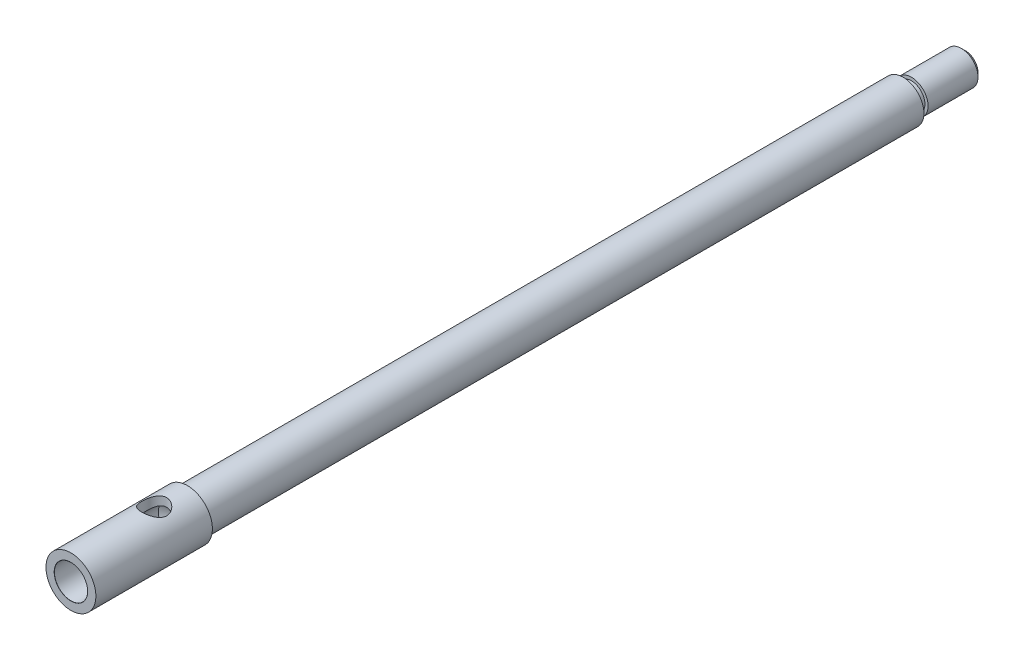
ISO-10303-21;
HEADER;
FILE_DESCRIPTION(('STEP AP214'),'2;1');
FILE_NAME('part.step','',(''),(''),'','','');
FILE_SCHEMA(('AUTOMOTIVE_DESIGN { 1 0 10303 214 1 1 1 1 }'));
ENDSEC;
DATA;
#1=APPLICATION_CONTEXT('core data for automotive mechanical design processes');
#2=APPLICATION_PROTOCOL_DEFINITION('international standard','automotive_design',2000,#1);
#3=PRODUCT_CONTEXT('',#1,'mechanical');
#4=PRODUCT('Part','Part','',(#3));
#5=PRODUCT_RELATED_PRODUCT_CATEGORY('part','',(#4));
#6=PRODUCT_DEFINITION_FORMATION('','',#4);
#7=PRODUCT_DEFINITION_CONTEXT('part definition',#1,'design');
#8=PRODUCT_DEFINITION('design','',#6,#7);
#9=PRODUCT_DEFINITION_SHAPE('','',#8);
#10=(LENGTH_UNIT() NAMED_UNIT(*) SI_UNIT(.MILLI.,.METRE.));
#11=(NAMED_UNIT(*) PLANE_ANGLE_UNIT() SI_UNIT($,.RADIAN.));
#12=(NAMED_UNIT(*) SI_UNIT($,.STERADIAN.) SOLID_ANGLE_UNIT());
#13=UNCERTAINTY_MEASURE_WITH_UNIT(LENGTH_MEASURE(1.E-05),#10,'distance_accuracy_value','');
#14=(GEOMETRIC_REPRESENTATION_CONTEXT(3) GLOBAL_UNCERTAINTY_ASSIGNED_CONTEXT((#13)) GLOBAL_UNIT_ASSIGNED_CONTEXT((#10,
#11,#12)) REPRESENTATION_CONTEXT('',''));
#15=CARTESIAN_POINT('',(0.,0.,0.));
#16=DIRECTION('',(0.,0.,1.));
#17=DIRECTION('',(1.,0.,0.));
#18=AXIS2_PLACEMENT_3D('',#15,#16,#17);
#19=CARTESIAN_POINT('',(0.,0.,13.));
#20=DIRECTION('',(0.,0.,-1.));
#21=DIRECTION('',(-1.,0.,0.));
#22=AXIS2_PLACEMENT_3D('',#19,#20,#21);
#23=CYLINDRICAL_SURFACE('',#22,4.);
#24=CARTESIAN_POINT('',(0.,0.,1.00000000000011));
#25=DIRECTION('',(0.,0.,1.));
#26=DIRECTION('',(1.,0.,0.));
#27=AXIS2_PLACEMENT_3D('',#24,#25,#26);
#28=CIRCLE('',#27,4.);
#29=CARTESIAN_POINT('',(-4.,0.,1.00000000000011));
#30=VERTEX_POINT('',#29);
#31=EDGE_CURVE('E100',#30,#30,#28,.T.);
#32=CARTESIAN_POINT('',(0.,0.,13.));
#33=DIRECTION('',(0.,0.,1.));
#34=DIRECTION('',(1.,0.,0.));
#35=AXIS2_PLACEMENT_3D('',#32,#33,#34);
#36=CIRCLE('',#35,4.);
#37=CARTESIAN_POINT('',(-4.,0.,13.));
#38=VERTEX_POINT('',#37);
#39=EDGE_CURVE('E96',#38,#38,#36,.T.);
#40=CARTESIAN_POINT('',(-4.,0.,1.00000000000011));
#41=CARTESIAN_POINT('',(-4.,0.,1.1250000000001));
#42=CARTESIAN_POINT('',(-4.,0.,1.2500000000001));
#43=CARTESIAN_POINT('',(-4.,0.,1.5000000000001));
#44=CARTESIAN_POINT('',(-4.,0.,1.6250000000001));
#45=CARTESIAN_POINT('',(-4.,0.,1.8750000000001));
#46=CARTESIAN_POINT('',(-4.,0.,2.0000000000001));
#47=CARTESIAN_POINT('',(-4.,0.,2.25000000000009));
#48=CARTESIAN_POINT('',(-4.,0.,2.37500000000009));
#49=CARTESIAN_POINT('',(-4.,0.,2.62500000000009));
#50=CARTESIAN_POINT('',(-4.,0.,2.75000000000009));
#51=CARTESIAN_POINT('',(-4.,0.,3.00000000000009));
#52=CARTESIAN_POINT('',(-4.,0.,3.12500000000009));
#53=CARTESIAN_POINT('',(-4.,0.,3.37500000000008));
#54=CARTESIAN_POINT('',(-4.,0.,3.50000000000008));
#55=CARTESIAN_POINT('',(-4.,0.,3.75000000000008));
#56=CARTESIAN_POINT('',(-4.,0.,3.87500000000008));
#57=CARTESIAN_POINT('',(-4.,0.,4.12500000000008));
#58=CARTESIAN_POINT('',(-4.,0.,4.25000000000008));
#59=CARTESIAN_POINT('',(-4.,0.,4.50000000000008));
#60=CARTESIAN_POINT('',(-4.,0.,4.62500000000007));
#61=CARTESIAN_POINT('',(-4.,0.,4.87500000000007));
#62=CARTESIAN_POINT('',(-4.,0.,5.00000000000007));
#63=CARTESIAN_POINT('',(-4.,0.,5.25000000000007));
#64=CARTESIAN_POINT('',(-4.,0.,5.37500000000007));
#65=CARTESIAN_POINT('',(-4.,0.,5.62500000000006));
#66=CARTESIAN_POINT('',(-4.,0.,5.75000000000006));
#67=CARTESIAN_POINT('',(-4.,0.,6.00000000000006));
#68=CARTESIAN_POINT('',(-4.,0.,6.12500000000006));
#69=CARTESIAN_POINT('',(-4.,0.,6.37500000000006));
#70=CARTESIAN_POINT('',(-4.,0.,6.50000000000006));
#71=CARTESIAN_POINT('',(-4.,0.,6.75000000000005));
#72=CARTESIAN_POINT('',(-4.,0.,6.87500000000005));
#73=CARTESIAN_POINT('',(-4.,0.,7.12500000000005));
#74=CARTESIAN_POINT('',(-4.,0.,7.25000000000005));
#75=CARTESIAN_POINT('',(-4.,0.,7.50000000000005));
#76=CARTESIAN_POINT('',(-4.,0.,7.62500000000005));
#77=CARTESIAN_POINT('',(-4.,0.,7.87500000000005));
#78=CARTESIAN_POINT('',(-4.,0.,8.00000000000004));
#79=CARTESIAN_POINT('',(-4.,0.,8.25000000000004));
#80=CARTESIAN_POINT('',(-4.,0.,8.37500000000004));
#81=CARTESIAN_POINT('',(-4.,0.,8.62500000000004));
#82=CARTESIAN_POINT('',(-4.,0.,8.75000000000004));
#83=CARTESIAN_POINT('',(-4.,0.,9.00000000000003));
#84=CARTESIAN_POINT('',(-4.,0.,9.12500000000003));
#85=CARTESIAN_POINT('',(-4.,0.,9.37500000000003));
#86=CARTESIAN_POINT('',(-4.,0.,9.50000000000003));
#87=CARTESIAN_POINT('',(-4.,0.,9.75000000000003));
#88=CARTESIAN_POINT('',(-4.,0.,9.87500000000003));
#89=CARTESIAN_POINT('',(-4.,0.,10.125));
#90=CARTESIAN_POINT('',(-4.,0.,10.25));
#91=CARTESIAN_POINT('',(-4.,0.,10.5));
#92=CARTESIAN_POINT('',(-4.,0.,10.625));
#93=CARTESIAN_POINT('',(-4.,0.,10.875));
#94=CARTESIAN_POINT('',(-4.,0.,11.));
#95=CARTESIAN_POINT('',(-4.,0.,11.25));
#96=CARTESIAN_POINT('',(-4.,0.,11.375));
#97=CARTESIAN_POINT('',(-4.,0.,11.625));
#98=CARTESIAN_POINT('',(-4.,0.,11.75));
#99=CARTESIAN_POINT('',(-4.,0.,12.));
#100=CARTESIAN_POINT('',(-4.,0.,12.125));
#101=CARTESIAN_POINT('',(-4.,0.,12.375));
#102=CARTESIAN_POINT('',(-4.,0.,12.5));
#103=CARTESIAN_POINT('',(-4.,0.,12.75));
#104=CARTESIAN_POINT('',(-4.,0.,12.875));
#105=CARTESIAN_POINT('',(-4.,0.,13.));
#106=B_SPLINE_CURVE_WITH_KNOTS('',3,(#40,#41,#42,#43,#44,#45,#46,#47,#48,#49,#50,#51,#52,#53,
#54,#55,#56,#57,#58,#59,#60,#61,#62,#63,#64,#65,#66,#67,#68,#69,#70,#71,#72,#73,#74,#75,#76,#77,
#78,#79,#80,#81,#82,#83,#84,#85,#86,#87,#88,#89,#90,#91,#92,#93,#94,#95,#96,#97,#98,#99,#100,
#101,#102,#103,#104,#105),.UNSPECIFIED.,.F.,.F.,(4,2,2,2,2,2,2,2,2,2,2,2,2,2,2,2,2,2,2,2,2,2,2,
2,2,2,2,2,2,2,2,2,4),(0.,0.374999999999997,0.749999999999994,1.12499999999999,1.49999999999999,
1.87499999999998,2.24999999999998,2.62499999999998,2.99999999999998,3.37499999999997,
3.74999999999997,4.12499999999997,4.49999999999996,4.87499999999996,5.24999999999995,
5.62499999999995,5.99999999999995,6.37499999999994,6.74999999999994,7.12499999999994,
7.49999999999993,7.87499999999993,8.24999999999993,8.62499999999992,8.99999999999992,
9.37499999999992,9.74999999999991,10.1249999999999,10.4999999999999,10.8749999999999,
11.2499999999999,11.6249999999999,11.9999999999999),.UNSPECIFIED.);
#107=EDGE_CURVE('BSEAM49',#30,#38,#106,.T.);
#108=ORIENTED_EDGE('',*,*,#31,.T.);
#109=ORIENTED_EDGE('',*,*,#39,.F.);
#110=ORIENTED_EDGE('',*,*,#107,.T.);
#111=ORIENTED_EDGE('',*,*,#107,.F.);
#112=EDGE_LOOP('',(#108,#110,#109,#111));
#113=FACE_BOUND('',#112,.T.);
#114=ADVANCED_FACE('F49',(#113),#23,.T.);
#115=CARTESIAN_POINT('',(0.,0.,13.));
#116=DIRECTION('',(0.,0.,1.));
#117=DIRECTION('',(1.,0.,0.));
#118=AXIS2_PLACEMENT_3D('',#115,#116,#117);
#119=PLANE('',#118);
#120=CARTESIAN_POINT('',(0.,0.,13.));
#121=DIRECTION('',(0.,0.,1.));
#122=DIRECTION('',(1.,0.,0.));
#123=AXIS2_PLACEMENT_3D('',#120,#121,#122);
#124=CIRCLE('',#123,3.25);
#125=CARTESIAN_POINT('',(3.25,0.,13.));
#126=VERTEX_POINT('',#125);
#127=EDGE_CURVE('E97',#126,#126,#124,.T.);
#128=ORIENTED_EDGE('',*,*,#127,.F.);
#129=EDGE_LOOP('',(#128));
#130=FACE_BOUND('',#129,.T.);
#131=ORIENTED_EDGE('',*,*,#39,.T.);
#132=EDGE_LOOP('',(#131));
#133=FACE_BOUND('',#132,.T.);
#134=ADVANCED_FACE('F156',(#130,#133),#119,.T.);
#135=CARTESIAN_POINT('',(0.,0.,0.));
#136=DIRECTION('',(0.,0.,1.));
#137=DIRECTION('',(1.,0.,0.));
#138=AXIS2_PLACEMENT_3D('',#135,#136,#137);
#139=PLANE('',#138);
#140=CARTESIAN_POINT('',(0.,0.,0.));
#141=DIRECTION('',(0.,0.,1.));
#142=DIRECTION('',(1.,0.,0.));
#143=AXIS2_PLACEMENT_3D('',#140,#141,#142);
#144=CIRCLE('',#143,2.99999999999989);
#145=CARTESIAN_POINT('',(2.99999999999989,0.,0.));
#146=VERTEX_POINT('',#145);
#147=EDGE_CURVE('E105',#146,#146,#144,.F.);
#148=ORIENTED_EDGE('',*,*,#147,.T.);
#149=EDGE_LOOP('',(#148));
#150=FACE_BOUND('',#149,.T.);
#151=ADVANCED_FACE('F161',(#150),#139,.F.);
#152=CARTESIAN_POINT('',(0.,0.,15.));
#153=DIRECTION('',(0.,0.,-1.));
#154=DIRECTION('',(-1.,0.,0.));
#155=AXIS2_PLACEMENT_3D('',#152,#153,#154);
#156=CYLINDRICAL_SURFACE('',#155,3.25);
#157=CARTESIAN_POINT('',(0.,0.,15.));
#158=DIRECTION('',(0.,0.,1.));
#159=DIRECTION('',(1.,0.,0.));
#160=AXIS2_PLACEMENT_3D('',#157,#158,#159);
#161=CIRCLE('',#160,3.25);
#162=CARTESIAN_POINT('',(3.25,0.,15.));
#163=VERTEX_POINT('',#162);
#164=EDGE_CURVE('E91',#163,#163,#161,.T.);
#165=ORIENTED_EDGE('',*,*,#164,.F.);
#166=EDGE_LOOP('',(#165));
#167=FACE_BOUND('',#166,.T.);
#168=ORIENTED_EDGE('',*,*,#127,.T.);
#169=EDGE_LOOP('',(#168));
#170=FACE_BOUND('',#169,.T.);
#171=ADVANCED_FACE('F167',(#167,#170),#156,.T.);
#172=CARTESIAN_POINT('',(0.,0.,187.));
#173=DIRECTION('',(0.,0.,-1.));
#174=DIRECTION('',(-1.,0.,0.));
#175=AXIS2_PLACEMENT_3D('',#172,#173,#174);
#176=CYLINDRICAL_SURFACE('',#175,5.);
#177=CARTESIAN_POINT('',(0.,0.,187.));
#178=DIRECTION('',(0.,0.,1.));
#179=DIRECTION('',(1.,0.,0.));
#180=AXIS2_PLACEMENT_3D('',#177,#178,#179);
#181=CIRCLE('',#180,5.);
#182=CARTESIAN_POINT('',(5.,0.,187.));
#183=VERTEX_POINT('',#182);
#184=EDGE_CURVE('E88',#183,#183,#181,.T.);
#185=ORIENTED_EDGE('',*,*,#184,.F.);
#186=EDGE_LOOP('',(#185));
#187=FACE_BOUND('',#186,.T.);
#188=CARTESIAN_POINT('',(0.,0.,15.));
#189=DIRECTION('',(0.,0.,1.));
#190=DIRECTION('',(1.,0.,0.));
#191=AXIS2_PLACEMENT_3D('',#188,#189,#190);
#192=CIRCLE('',#191,5.);
#193=CARTESIAN_POINT('',(5.,0.,15.));
#194=VERTEX_POINT('',#193);
#195=EDGE_CURVE('E86',#194,#194,#192,.T.);
#196=ORIENTED_EDGE('',*,*,#195,.T.);
#197=EDGE_LOOP('',(#196));
#198=FACE_BOUND('',#197,.T.);
#199=ADVANCED_FACE('F172',(#187,#198),#176,.T.);
#200=CARTESIAN_POINT('',(0.,0.,15.));
#201=DIRECTION('',(0.,0.,1.));
#202=DIRECTION('',(1.,0.,0.));
#203=AXIS2_PLACEMENT_3D('',#200,#201,#202);
#204=PLANE('',#203);
#205=ORIENTED_EDGE('',*,*,#164,.T.);
#206=EDGE_LOOP('',(#205));
#207=FACE_BOUND('',#206,.T.);
#208=ORIENTED_EDGE('',*,*,#195,.F.);
#209=EDGE_LOOP('',(#208));
#210=FACE_BOUND('',#209,.T.);
#211=ADVANCED_FACE('F175',(#207,#210),#204,.F.);
#212=CARTESIAN_POINT('',(0.,0.,215.));
#213=DIRECTION('',(0.,0.,-1.));
#214=DIRECTION('',(-1.,0.,0.));
#215=AXIS2_PLACEMENT_3D('',#212,#213,#214);
#216=CYLINDRICAL_SURFACE('',#215,6.);
#217=CARTESIAN_POINT('',(0.,-6.,198.));
#218=CARTESIAN_POINT('',(0.0788941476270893,-5.99999934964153,197.999999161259));
#219=CARTESIAN_POINT('',(0.157796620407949,-5.99843869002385,197.996882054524));
#220=CARTESIAN_POINT('',(0.31500199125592,-5.99224358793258,197.98446072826));
#221=CARTESIAN_POINT('',(0.393304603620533,-5.98760776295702,197.975153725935));
#222=CARTESIAN_POINT('',(0.626628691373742,-5.96921978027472,197.938042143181));
#223=CARTESIAN_POINT('',(0.779952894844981,-5.95098734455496,197.901047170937));
#224=CARTESIAN_POINT('',(1.07683586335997,-5.90448966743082,197.804418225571));
#225=CARTESIAN_POINT('',(1.22043005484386,-5.87626344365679,197.744872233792));
#226=CARTESIAN_POINT('',(1.49540820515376,-5.81237302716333,197.605288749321));
#227=CARTESIAN_POINT('',(1.62679312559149,-5.77670942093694,197.525252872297));
#228=CARTESIAN_POINT('',(1.88252701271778,-5.69868752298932,197.34144601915));
#229=CARTESIAN_POINT('',(2.0059694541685,-5.65605474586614,197.236532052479));
#230=CARTESIAN_POINT('',(2.23433451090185,-5.56980033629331,197.008444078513));
#231=CARTESIAN_POINT('',(2.3392430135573,-5.5261779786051,196.885256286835));
#232=CARTESIAN_POINT('',(2.53576864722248,-5.43896347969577,196.612515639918));
#233=CARTESIAN_POINT('',(2.625724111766,-5.3956360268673,196.461659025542));
#234=CARTESIAN_POINT('',(2.74034031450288,-5.33782449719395,196.224049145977));
#235=CARTESIAN_POINT('',(2.77516786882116,-5.31974570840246,196.142929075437));
#236=CARTESIAN_POINT('',(2.83769299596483,-5.28665768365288,195.97739942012));
#237=CARTESIAN_POINT('',(2.86539478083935,-5.27164663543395,195.892991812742));
#238=CARTESIAN_POINT('',(2.91188280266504,-5.24610341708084,195.726604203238));
#239=CARTESIAN_POINT('',(2.93110042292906,-5.23535838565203,195.644777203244));
#240=CARTESIAN_POINT('',(2.96263559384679,-5.21757784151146,195.47944509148));
#241=CARTESIAN_POINT('',(2.97495680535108,-5.21054036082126,195.395940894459));
#242=CARTESIAN_POINT('',(2.99251382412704,-5.20047756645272,195.227993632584));
#243=CARTESIAN_POINT('',(2.99775389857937,-5.19744983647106,195.143551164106));
#244=CARTESIAN_POINT('',(3.00108452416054,-5.19552555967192,194.974506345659));
#245=CARTESIAN_POINT('',(2.9991757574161,-5.19662861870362,194.889904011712));
#246=CARTESIAN_POINT('',(2.98404973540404,-5.20534668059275,194.657246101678));
#247=CARTESIAN_POINT('',(2.96335042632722,-5.21726794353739,194.509755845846));
#248=CARTESIAN_POINT('',(2.90082280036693,-5.25228182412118,194.220806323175));
#249=CARTESIAN_POINT('',(2.85898775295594,-5.2753780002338,194.079348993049));
#250=CARTESIAN_POINT('',(2.75462843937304,-5.33062568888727,193.802320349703));
#251=CARTESIAN_POINT('',(2.69164495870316,-5.36297559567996,193.666962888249));
#252=CARTESIAN_POINT('',(2.54712530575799,-5.43310175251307,193.408095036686));
#253=CARTESIAN_POINT('',(2.46558080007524,-5.47088043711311,193.28459000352));
#254=CARTESIAN_POINT('',(2.27419808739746,-5.55339485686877,193.03643690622));
#255=CARTESIAN_POINT('',(2.16208335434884,-5.59840533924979,192.913629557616));
#256=CARTESIAN_POINT('',(1.918666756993,-5.6864286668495,192.687793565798));
#257=CARTESIAN_POINT('',(1.78735577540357,-5.72944054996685,192.584774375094));
#258=CARTESIAN_POINT('',(1.501549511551,-5.81105962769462,192.396943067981));
#259=CARTESIAN_POINT('',(1.34626077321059,-5.8493695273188,192.313198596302));
#260=CARTESIAN_POINT('',(1.02139864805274,-5.91473643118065,192.173708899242));
#261=CARTESIAN_POINT('',(0.85183672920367,-5.94180236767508,192.11794144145));
#262=CARTESIAN_POINT('',(0.518299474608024,-5.97973001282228,192.040573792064));
#263=CARTESIAN_POINT('',(0.355024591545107,-5.99174814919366,192.016526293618));
#264=CARTESIAN_POINT('',(0.0263387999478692,-6.00219040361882,191.995605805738));
#265=CARTESIAN_POINT('',(-0.139071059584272,-6.00062096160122,191.998719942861));
#266=CARTESIAN_POINT('',(-0.453698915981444,-5.98473576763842,192.03062006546));
#267=CARTESIAN_POINT('',(-0.603178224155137,-5.97141737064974,192.057397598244));
#268=CARTESIAN_POINT('',(-0.89522067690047,-5.93466513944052,192.132714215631));
#269=CARTESIAN_POINT('',(-1.03778305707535,-5.91123019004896,192.181255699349));
#270=CARTESIAN_POINT('',(-1.31666582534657,-5.85552754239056,192.299995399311));
#271=CARTESIAN_POINT('',(-1.45269119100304,-5.82302645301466,192.370773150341));
#272=CARTESIAN_POINT('',(-1.71138408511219,-5.75231922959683,192.531322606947));
#273=CARTESIAN_POINT('',(-1.83404588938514,-5.71411066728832,192.621102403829));
#274=CARTESIAN_POINT('',(-2.07530306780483,-5.63124663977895,192.827281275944));
#275=CARTESIAN_POINT('',(-2.19231623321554,-5.58632654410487,192.945428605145));
#276=CARTESIAN_POINT('',(-2.40556896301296,-5.49787174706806,193.199775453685));
#277=CARTESIAN_POINT('',(-2.50179415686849,-5.45433802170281,193.33598735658));
#278=CARTESIAN_POINT('',(-2.67512374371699,-5.3715357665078,193.63093096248));
#279=CARTESIAN_POINT('',(-2.7510764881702,-5.33257588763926,193.790433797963));
#280=CARTESIAN_POINT('',(-2.87424847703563,-5.26722216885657,194.122530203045));
#281=CARTESIAN_POINT('',(-2.92150474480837,-5.24081214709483,194.295106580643));
#282=CARTESIAN_POINT('',(-2.9815850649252,-5.2068450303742,194.630730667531));
#283=CARTESIAN_POINT('',(-2.99727899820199,-5.19772150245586,194.79310275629));
#284=CARTESIAN_POINT('',(-3.00206745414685,-5.19496064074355,195.118341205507));
#285=CARTESIAN_POINT('',(-2.9911735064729,-5.20131659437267,195.281207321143));
#286=CARTESIAN_POINT('',(-2.9457784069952,-5.227135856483,195.586450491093));
#287=CARTESIAN_POINT('',(-2.91362505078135,-5.24529281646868,195.729301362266));
#288=CARTESIAN_POINT('',(-2.82952596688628,-5.29113050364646,196.007424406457));
#289=CARTESIAN_POINT('',(-2.77757387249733,-5.31881429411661,196.142694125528));
#290=CARTESIAN_POINT('',(-2.65144766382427,-5.38285583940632,196.411874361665));
#291=CARTESIAN_POINT('',(-2.57601505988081,-5.41967139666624,196.545082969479));
#292=CARTESIAN_POINT('',(-2.4064512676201,-5.49706022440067,196.797824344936));
#293=CARTESIAN_POINT('',(-2.31231035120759,-5.53763544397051,196.917349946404));
#294=CARTESIAN_POINT('',(-2.094616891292,-5.62386853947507,197.154422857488));
#295=CARTESIAN_POINT('',(-1.96888052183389,-5.66954494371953,197.269965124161));
#296=CARTESIAN_POINT('',(-1.69843715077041,-5.75633712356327,197.478801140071));
#297=CARTESIAN_POINT('',(-1.55371998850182,-5.79745043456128,197.572082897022));
#298=CARTESIAN_POINT('',(-1.32452333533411,-5.85251406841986,197.693178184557));
#299=CARTESIAN_POINT('',(-1.24575314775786,-5.86982524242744,197.730520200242));
#300=CARTESIAN_POINT('',(-1.08479725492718,-5.90168845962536,197.798361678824));
#301=CARTESIAN_POINT('',(-1.0026132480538,-5.91624185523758,197.828864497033));
#302=CARTESIAN_POINT('',(-0.835616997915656,-5.94212690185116,197.882607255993));
#303=CARTESIAN_POINT('',(-0.750810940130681,-5.95346557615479,197.905863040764));
#304=CARTESIAN_POINT('',(-0.57914235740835,-5.97260771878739,197.944882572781));
#305=CARTESIAN_POINT('',(-0.492281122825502,-5.98041334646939,197.960650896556));
#306=CARTESIAN_POINT('',(-0.337824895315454,-5.99085829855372,197.981684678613));
#307=CARTESIAN_POINT('',(-0.270495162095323,-5.99428035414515,197.988546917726));
#308=CARTESIAN_POINT('',(-0.135445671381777,-5.99885151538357,197.997705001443));
#309=CARTESIAN_POINT('',(-0.0677259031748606,-6.00000055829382,198.000000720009));
#310=CARTESIAN_POINT('',(0.,-6.,198.));
#311=B_SPLINE_CURVE_WITH_KNOTS('',3,(#217,#218,#219,#220,#221,#222,#223,#224,#225,#226,#227,
#228,#229,#230,#231,#232,#233,#234,#235,#236,#237,#238,#239,#240,#241,#242,#243,#244,#245,#246,
#247,#248,#249,#250,#251,#252,#253,#254,#255,#256,#257,#258,#259,#260,#261,#262,#263,#264,#265,
#266,#267,#268,#269,#270,#271,#272,#273,#274,#275,#276,#277,#278,#279,#280,#281,#282,#283,#284,
#285,#286,#287,#288,#289,#290,#291,#292,#293,#294,#295,#296,#297,#298,#299,#300,#301,#302,#303,
#304,#305,#306,#307,#308,#309,#310),.UNSPECIFIED.,.T.,.F.,(4,2,2,2,2,2,2,2,2,2,2,2,2,2,2,2,2,2,
2,2,2,2,2,2,2,2,2,2,2,2,2,2,2,2,2,2,2,2,2,2,2,2,2,2,2,2,4),(0.,0.236611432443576,
0.473329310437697,0.947100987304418,1.41904300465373,1.89094781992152,2.39140181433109,
2.89223525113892,3.43190833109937,3.70192714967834,3.97178599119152,4.22563720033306,
4.47935352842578,4.73291689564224,4.98645606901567,5.43238672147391,5.87845946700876,
6.334922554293,6.79159098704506,7.30616358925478,7.82098138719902,8.35970601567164,
8.8980018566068,9.39171406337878,9.88519228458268,10.3404225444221,10.7957029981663,
11.2640010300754,11.7324988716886,12.2470036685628,12.7618630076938,13.3016558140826,
13.8407507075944,14.3280945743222,14.8152271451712,15.2559532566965,15.6968212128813,
16.1673090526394,16.6380421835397,17.1659726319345,17.6941868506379,17.9605054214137,
18.2266930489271,18.4922945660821,18.7577335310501,18.9608446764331,19.1639614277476),.UNSPECIFIED.);
#312=CARTESIAN_POINT('',(0.,-6.,198.));
#313=VERTEX_POINT('',#312);
#314=EDGE_CURVE('E11',#313,#313,#311,.T.);
#315=ORIENTED_EDGE('',*,*,#314,.T.);
#316=EDGE_LOOP('',(#315));
#317=FACE_BOUND('',#316,.T.);
#318=CARTESIAN_POINT('',(0.,6.,192.));
#319=CARTESIAN_POINT('',(0.0788941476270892,5.99999934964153,192.000000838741));
#320=CARTESIAN_POINT('',(0.157796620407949,5.99843869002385,192.003117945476));
#321=CARTESIAN_POINT('',(0.31500199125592,5.99224358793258,192.01553927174));
#322=CARTESIAN_POINT('',(0.393304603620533,5.98760776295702,192.024846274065));
#323=CARTESIAN_POINT('',(0.626628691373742,5.96921978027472,192.061957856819));
#324=CARTESIAN_POINT('',(0.779952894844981,5.95098734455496,192.098952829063));
#325=CARTESIAN_POINT('',(1.07683586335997,5.90448966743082,192.195581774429));
#326=CARTESIAN_POINT('',(1.22043005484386,5.87626344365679,192.255127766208));
#327=CARTESIAN_POINT('',(1.49540820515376,5.81237302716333,192.394711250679));
#328=CARTESIAN_POINT('',(1.62679312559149,5.77670942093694,192.474747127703));
#329=CARTESIAN_POINT('',(1.88252701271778,5.69868752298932,192.65855398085));
#330=CARTESIAN_POINT('',(2.0059694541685,5.65605474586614,192.763467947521));
#331=CARTESIAN_POINT('',(2.23433451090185,5.56980033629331,192.991555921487));
#332=CARTESIAN_POINT('',(2.3392430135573,5.5261779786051,193.114743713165));
#333=CARTESIAN_POINT('',(2.53576864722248,5.43896347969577,193.387484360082));
#334=CARTESIAN_POINT('',(2.625724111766,5.3956360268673,193.538340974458));
#335=CARTESIAN_POINT('',(2.74034031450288,5.33782449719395,193.775950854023));
#336=CARTESIAN_POINT('',(2.77516786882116,5.31974570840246,193.857070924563));
#337=CARTESIAN_POINT('',(2.83769299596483,5.28665768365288,194.02260057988));
#338=CARTESIAN_POINT('',(2.86539478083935,5.27164663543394,194.107008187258));
#339=CARTESIAN_POINT('',(2.91188280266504,5.24610341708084,194.273395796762));
#340=CARTESIAN_POINT('',(2.93110042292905,5.23535838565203,194.355222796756));
#341=CARTESIAN_POINT('',(2.96263559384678,5.21757784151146,194.52055490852));
#342=CARTESIAN_POINT('',(2.97495680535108,5.21054036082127,194.604059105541));
#343=CARTESIAN_POINT('',(2.99251382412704,5.20047756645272,194.772006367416));
#344=CARTESIAN_POINT('',(2.99775389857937,5.19744983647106,194.856448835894));
#345=CARTESIAN_POINT('',(3.00108452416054,5.19552555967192,195.025493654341));
#346=CARTESIAN_POINT('',(2.9991757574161,5.19662861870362,195.110095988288));
#347=CARTESIAN_POINT('',(2.98404973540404,5.20534668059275,195.342753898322));
#348=CARTESIAN_POINT('',(2.96335042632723,5.21726794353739,195.490244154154));
#349=CARTESIAN_POINT('',(2.90082280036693,5.25228182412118,195.779193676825));
#350=CARTESIAN_POINT('',(2.85898775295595,5.2753780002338,195.920651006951));
#351=CARTESIAN_POINT('',(2.75462843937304,5.33062568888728,196.197679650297));
#352=CARTESIAN_POINT('',(2.69164495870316,5.36297559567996,196.333037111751));
#353=CARTESIAN_POINT('',(2.54712530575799,5.43310175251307,196.591904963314));
#354=CARTESIAN_POINT('',(2.46558080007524,5.47088043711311,196.71540999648));
#355=CARTESIAN_POINT('',(2.27419808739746,5.55339485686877,196.96356309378));
#356=CARTESIAN_POINT('',(2.16208335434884,5.59840533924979,197.086370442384));
#357=CARTESIAN_POINT('',(1.918666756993,5.6864286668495,197.312206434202));
#358=CARTESIAN_POINT('',(1.78735577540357,5.72944054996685,197.415225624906));
#359=CARTESIAN_POINT('',(1.501549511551,5.81105962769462,197.603056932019));
#360=CARTESIAN_POINT('',(1.34626077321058,5.8493695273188,197.686801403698));
#361=CARTESIAN_POINT('',(1.02139864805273,5.91473643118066,197.826291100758));
#362=CARTESIAN_POINT('',(0.851836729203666,5.94180236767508,197.88205855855));
#363=CARTESIAN_POINT('',(0.518299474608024,5.97973001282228,197.959426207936));
#364=CARTESIAN_POINT('',(0.355024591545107,5.99174814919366,197.983473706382));
#365=CARTESIAN_POINT('',(0.026338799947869,6.00219040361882,198.004394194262));
#366=CARTESIAN_POINT('',(-0.139071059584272,6.00062096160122,198.00128005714));
#367=CARTESIAN_POINT('',(-0.453698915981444,5.98473576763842,197.96937993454));
#368=CARTESIAN_POINT('',(-0.603178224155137,5.97141737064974,197.942602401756));
#369=CARTESIAN_POINT('',(-0.89522067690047,5.93466513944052,197.867285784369));
#370=CARTESIAN_POINT('',(-1.03778305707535,5.91123019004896,197.818744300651));
#371=CARTESIAN_POINT('',(-1.31666582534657,5.85552754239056,197.700004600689));
#372=CARTESIAN_POINT('',(-1.45269119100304,5.82302645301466,197.629226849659));
#373=CARTESIAN_POINT('',(-1.71138408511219,5.75231922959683,197.468677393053));
#374=CARTESIAN_POINT('',(-1.83404588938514,5.71411066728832,197.378897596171));
#375=CARTESIAN_POINT('',(-2.07530306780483,5.63124663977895,197.172718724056));
#376=CARTESIAN_POINT('',(-2.19231623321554,5.58632654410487,197.054571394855));
#377=CARTESIAN_POINT('',(-2.40556896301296,5.49787174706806,196.800224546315));
#378=CARTESIAN_POINT('',(-2.50179415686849,5.45433802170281,196.66401264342));
#379=CARTESIAN_POINT('',(-2.675123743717,5.3715357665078,196.36906903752));
#380=CARTESIAN_POINT('',(-2.75107648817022,5.33257588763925,196.209566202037));
#381=CARTESIAN_POINT('',(-2.87424847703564,5.26722216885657,195.877469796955));
#382=CARTESIAN_POINT('',(-2.92150474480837,5.24081214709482,195.704893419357));
#383=CARTESIAN_POINT('',(-2.9815850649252,5.2068450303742,195.369269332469));
#384=CARTESIAN_POINT('',(-2.99727899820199,5.19772150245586,195.20689724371));
#385=CARTESIAN_POINT('',(-3.00206745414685,5.19496064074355,194.881658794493));
#386=CARTESIAN_POINT('',(-2.9911735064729,5.20131659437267,194.718792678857));
#387=CARTESIAN_POINT('',(-2.9457784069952,5.227135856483,194.413549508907));
#388=CARTESIAN_POINT('',(-2.91362505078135,5.24529281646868,194.270698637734));
#389=CARTESIAN_POINT('',(-2.82952596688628,5.29113050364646,193.992575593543));
#390=CARTESIAN_POINT('',(-2.77757387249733,5.31881429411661,193.857305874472));
#391=CARTESIAN_POINT('',(-2.65144766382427,5.38285583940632,193.588125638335));
#392=CARTESIAN_POINT('',(-2.57601505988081,5.41967139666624,193.454917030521));
#393=CARTESIAN_POINT('',(-2.4064512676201,5.49706022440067,193.202175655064));
#394=CARTESIAN_POINT('',(-2.31231035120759,5.53763544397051,193.082650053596));
#395=CARTESIAN_POINT('',(-2.094616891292,5.62386853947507,192.845577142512));
#396=CARTESIAN_POINT('',(-1.96888052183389,5.66954494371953,192.730034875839));
#397=CARTESIAN_POINT('',(-1.69843715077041,5.75633712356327,192.521198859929));
#398=CARTESIAN_POINT('',(-1.55371998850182,5.79745043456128,192.427917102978));
#399=CARTESIAN_POINT('',(-1.32452333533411,5.85251406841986,192.306821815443));
#400=CARTESIAN_POINT('',(-1.24575314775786,5.86982524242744,192.269479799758));
#401=CARTESIAN_POINT('',(-1.08479725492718,5.90168845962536,192.201638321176));
#402=CARTESIAN_POINT('',(-1.00261324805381,5.91624185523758,192.171135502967));
#403=CARTESIAN_POINT('',(-0.835616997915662,5.94212690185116,192.117392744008));
#404=CARTESIAN_POINT('',(-0.750810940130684,5.95346557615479,192.094136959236));
#405=CARTESIAN_POINT('',(-0.579142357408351,5.97260771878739,192.055117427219));
#406=CARTESIAN_POINT('',(-0.492281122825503,5.98041334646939,192.039349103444));
#407=CARTESIAN_POINT('',(-0.337824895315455,5.99085829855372,192.018315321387));
#408=CARTESIAN_POINT('',(-0.270495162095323,5.99428035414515,192.011453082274));
#409=CARTESIAN_POINT('',(-0.135445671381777,5.99885151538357,192.002294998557));
#410=CARTESIAN_POINT('',(-0.0677259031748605,6.00000055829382,191.999999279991));
#411=CARTESIAN_POINT('',(0.,6.,192.));
#412=B_SPLINE_CURVE_WITH_KNOTS('',3,(#318,#319,#320,#321,#322,#323,#324,#325,#326,#327,#328,
#329,#330,#331,#332,#333,#334,#335,#336,#337,#338,#339,#340,#341,#342,#343,#344,#345,#346,#347,
#348,#349,#350,#351,#352,#353,#354,#355,#356,#357,#358,#359,#360,#361,#362,#363,#364,#365,#366,
#367,#368,#369,#370,#371,#372,#373,#374,#375,#376,#377,#378,#379,#380,#381,#382,#383,#384,#385,
#386,#387,#388,#389,#390,#391,#392,#393,#394,#395,#396,#397,#398,#399,#400,#401,#402,#403,#404,
#405,#406,#407,#408,#409,#410,#411),.UNSPECIFIED.,.T.,.F.,(4,2,2,2,2,2,2,2,2,2,2,2,2,2,2,2,2,2,
2,2,2,2,2,2,2,2,2,2,2,2,2,2,2,2,2,2,2,2,2,2,2,2,2,2,2,2,4),(0.,0.236611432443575,
0.473329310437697,0.947100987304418,1.41904300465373,1.89094781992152,2.39140181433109,
2.89223525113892,3.43190833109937,3.70192714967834,3.97178599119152,4.22563720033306,
4.47935352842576,4.73291689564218,4.98645606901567,5.43238672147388,5.87845946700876,
6.334922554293,6.79159098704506,7.30616358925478,7.82098138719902,8.35970601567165,
8.8980018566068,9.39171406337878,9.88519228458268,10.3404225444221,10.7957029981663,
11.2640010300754,11.7324988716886,12.2470036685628,12.7618630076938,13.3016558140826,
13.8407507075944,14.3280945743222,14.8152271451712,15.2559532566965,15.6968212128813,
16.1673090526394,16.6380421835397,17.1659726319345,17.6941868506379,17.9605054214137,
18.2266930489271,18.4922945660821,18.7577335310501,18.9608446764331,19.1639614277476),.UNSPECIFIED.);
#413=CARTESIAN_POINT('',(0.,6.,192.));
#414=VERTEX_POINT('',#413);
#415=EDGE_CURVE('E62',#414,#414,#412,.T.);
#416=ORIENTED_EDGE('',*,*,#415,.T.);
#417=EDGE_LOOP('',(#416));
#418=FACE_BOUND('',#417,.T.);
#419=CARTESIAN_POINT('',(0.,0.,215.));
#420=DIRECTION('',(0.,0.,1.));
#421=DIRECTION('',(1.,0.,0.));
#422=AXIS2_PLACEMENT_3D('',#419,#420,#421);
#423=CIRCLE('',#422,6.);
#424=CARTESIAN_POINT('',(6.,0.,215.));
#425=VERTEX_POINT('',#424);
#426=EDGE_CURVE('E78',#425,#425,#423,.T.);
#427=ORIENTED_EDGE('',*,*,#426,.F.);
#428=EDGE_LOOP('',(#427));
#429=FACE_BOUND('',#428,.T.);
#430=CARTESIAN_POINT('',(0.,0.,187.));
#431=DIRECTION('',(0.,0.,1.));
#432=DIRECTION('',(1.,0.,0.));
#433=AXIS2_PLACEMENT_3D('',#430,#431,#432);
#434=CIRCLE('',#433,6.);
#435=CARTESIAN_POINT('',(6.,0.,187.));
#436=VERTEX_POINT('',#435);
#437=EDGE_CURVE('E74',#436,#436,#434,.T.);
#438=ORIENTED_EDGE('',*,*,#437,.T.);
#439=EDGE_LOOP('',(#438));
#440=FACE_BOUND('',#439,.T.);
#441=ADVANCED_FACE('F112',(#317,#418,#429,#440),#216,.T.);
#442=CARTESIAN_POINT('',(0.,0.,215.));
#443=DIRECTION('',(0.,0.,1.));
#444=DIRECTION('',(1.,0.,0.));
#445=AXIS2_PLACEMENT_3D('',#442,#443,#444);
#446=PLANE('',#445);
#447=CARTESIAN_POINT('',(0.,0.,215.));
#448=DIRECTION('',(0.,0.,1.));
#449=DIRECTION('',(1.,0.,0.));
#450=AXIS2_PLACEMENT_3D('',#447,#448,#449);
#451=CIRCLE('',#450,4.025);
#452=CARTESIAN_POINT('',(4.025,0.,215.));
#453=VERTEX_POINT('',#452);
#454=EDGE_CURVE('E81',#453,#453,#451,.T.);
#455=ORIENTED_EDGE('',*,*,#454,.F.);
#456=EDGE_LOOP('',(#455));
#457=FACE_BOUND('',#456,.T.);
#458=ORIENTED_EDGE('',*,*,#426,.T.);
#459=EDGE_LOOP('',(#458));
#460=FACE_BOUND('',#459,.T.);
#461=ADVANCED_FACE('F142',(#457,#460),#446,.T.);
#462=CARTESIAN_POINT('',(0.,0.,187.));
#463=DIRECTION('',(0.,0.,1.));
#464=DIRECTION('',(1.,0.,0.));
#465=AXIS2_PLACEMENT_3D('',#462,#463,#464);
#466=PLANE('',#465);
#467=ORIENTED_EDGE('',*,*,#184,.T.);
#468=EDGE_LOOP('',(#467));
#469=FACE_BOUND('',#468,.T.);
#470=ORIENTED_EDGE('',*,*,#437,.F.);
#471=EDGE_LOOP('',(#470));
#472=FACE_BOUND('',#471,.T.);
#473=ADVANCED_FACE('F144',(#469,#472),#466,.F.);
#474=CARTESIAN_POINT('',(0.,0.,1.00000000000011));
#475=DIRECTION('',(0.,0.,1.));
#476=DIRECTION('',(1.,0.,0.));
#477=AXIS2_PLACEMENT_3D('',#474,#475,#476);
#478=CONICAL_SURFACE('',#477,4.,0.78539816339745);
#479=ORIENTED_EDGE('',*,*,#147,.F.);
#480=EDGE_LOOP('',(#479));
#481=FACE_BOUND('',#480,.T.);
#482=ORIENTED_EDGE('',*,*,#31,.F.);
#483=EDGE_LOOP('',(#482));
#484=FACE_BOUND('',#483,.T.);
#485=ADVANCED_FACE('F52',(#481,#484),#478,.T.);
#486=CARTESIAN_POINT('',(0.,0.,190.));
#487=DIRECTION('',(0.,0.,1.));
#488=DIRECTION('',(1.,0.,0.));
#489=AXIS2_PLACEMENT_3D('',#486,#487,#488);
#490=CONICAL_SURFACE('',#489,3.99999999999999,1.02974425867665);
#491=CARTESIAN_POINT('',(0.,0.,187.59655752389));
#492=VERTEX_POINT('',#491);
#493=VERTEX_LOOP('',#492);
#494=FACE_BOUND('',#493,.T.);
#495=CARTESIAN_POINT('',(0.,0.,190.));
#496=DIRECTION('',(0.,0.,1.));
#497=DIRECTION('',(1.,0.,0.));
#498=AXIS2_PLACEMENT_3D('',#495,#496,#497);
#499=CIRCLE('',#498,3.99999999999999);
#500=CARTESIAN_POINT('',(3.99999999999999,0.,190.));
#501=VERTEX_POINT('',#500);
#502=EDGE_CURVE('E72',#501,#501,#499,.T.);
#503=ORIENTED_EDGE('',*,*,#502,.T.);
#504=EDGE_LOOP('',(#503));
#505=FACE_BOUND('',#504,.T.);
#506=ADVANCED_FACE('F65',(#494,#505),#490,.F.);
#507=CARTESIAN_POINT('',(0.,0.,215.));
#508=DIRECTION('',(0.,0.,1.));
#509=DIRECTION('',(1.,0.,0.));
#510=AXIS2_PLACEMENT_3D('',#507,#508,#509);
#511=CYLINDRICAL_SURFACE('',#510,3.99999999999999);
#512=CARTESIAN_POINT('',(0.,-3.99999999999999,198.));
#513=CARTESIAN_POINT('',(-0.0732613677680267,-3.99999929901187,197.999999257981));
#514=CARTESIAN_POINT('',(-0.146542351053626,-3.99798060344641,197.997309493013));
#515=CARTESIAN_POINT('',(-0.292508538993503,-3.98996245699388,197.986605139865));
#516=CARTESIAN_POINT('',(-0.365193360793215,-3.98396062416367,197.978587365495));
#517=CARTESIAN_POINT('',(-0.581731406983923,-3.96012745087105,197.946664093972));
#518=CARTESIAN_POINT('',(-0.723892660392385,-3.93646888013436,197.914889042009));
#519=CARTESIAN_POINT('',(-0.998506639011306,-3.8759149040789,197.832574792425));
#520=CARTESIAN_POINT('',(-1.13101263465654,-3.83910000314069,197.782149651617));
#521=CARTESIAN_POINT('',(-1.38483526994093,-3.75501017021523,197.664914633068));
#522=CARTESIAN_POINT('',(-1.50615516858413,-3.70773829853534,197.598109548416));
#523=CARTESIAN_POINT('',(-1.74693213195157,-3.60099357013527,197.443476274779));
#524=CARTESIAN_POINT('',(-1.86517631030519,-3.54079623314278,197.354274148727));
#525=CARTESIAN_POINT('',(-2.08606449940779,-3.41533027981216,197.160999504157));
#526=CARTESIAN_POINT('',(-2.18868391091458,-3.35005390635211,197.056904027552));
#527=CARTESIAN_POINT('',(-2.33993228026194,-3.2449223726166,196.879464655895));
#528=CARTESIAN_POINT('',(-2.39379458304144,-3.20528915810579,196.810369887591));
#529=CARTESIAN_POINT('',(-2.49548358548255,-3.12676887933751,196.667410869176));
#530=CARTESIAN_POINT('',(-2.54330846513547,-3.08788204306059,196.593545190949));
#531=CARTESIAN_POINT('',(-2.6326117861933,-3.01210562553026,196.44122820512));
#532=CARTESIAN_POINT('',(-2.67409784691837,-2.97521368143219,196.362782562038));
#533=CARTESIAN_POINT('',(-2.7504313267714,-2.90479339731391,196.201292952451));
#534=CARTESIAN_POINT('',(-2.78527982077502,-2.87126451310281,196.118249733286));
#535=CARTESIAN_POINT('',(-2.85760090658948,-2.79954532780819,195.921037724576));
#536=CARTESIAN_POINT('',(-2.89251037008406,-2.76315561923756,195.805230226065));
#537=CARTESIAN_POINT('',(-2.94841656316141,-2.70343128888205,195.567202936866));
#538=CARTESIAN_POINT('',(-2.96944514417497,-2.6800667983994,195.444998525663));
#539=CARTESIAN_POINT('',(-2.99625559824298,-2.65007535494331,195.195637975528));
#540=CARTESIAN_POINT('',(-3.00189887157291,-2.64360057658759,195.068447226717));
#541=CARTESIAN_POINT('',(-2.99696449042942,-2.64919059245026,194.814769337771));
#542=CARTESIAN_POINT('',(-2.9863810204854,-2.66126203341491,194.688282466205));
#543=CARTESIAN_POINT('',(-2.95195473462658,-2.69935247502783,194.45361749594));
#544=CARTESIAN_POINT('',(-2.92964971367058,-2.72374314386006,194.344927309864));
#545=CARTESIAN_POINT('',(-2.87411343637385,-2.78228385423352,194.133122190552));
#546=CARTESIAN_POINT('',(-2.84087167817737,-2.81644327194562,194.030012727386));
#547=CARTESIAN_POINT('',(-2.74066127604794,-2.9148353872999,193.767487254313));
#548=CARTESIAN_POINT('',(-2.66560296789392,-2.98451298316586,193.613199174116));
#549=CARTESIAN_POINT('',(-2.49236046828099,-3.13066596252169,193.32160694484));
#550=CARTESIAN_POINT('',(-2.39412008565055,-3.20715757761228,193.184345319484));
#551=CARTESIAN_POINT('',(-2.17303208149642,-3.36103344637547,192.924493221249));
#552=CARTESIAN_POINT('',(-2.0496275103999,-3.43839173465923,192.802358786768));
#553=CARTESIAN_POINT('',(-1.78084504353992,-3.584960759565,192.579472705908));
#554=CARTESIAN_POINT('',(-1.63551010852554,-3.65418696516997,192.478680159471));
#555=CARTESIAN_POINT('',(-1.35580416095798,-3.76559452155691,192.320038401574));
#556=CARTESIAN_POINT('',(-1.22507974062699,-3.81041541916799,192.257630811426));
#557=CARTESIAN_POINT('',(-0.952704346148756,-3.88745808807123,192.151550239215));
#558=CARTESIAN_POINT('',(-0.811060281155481,-3.91968774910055,192.107865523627));
#559=CARTESIAN_POINT('',(-0.519352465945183,-3.96891177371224,192.041493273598));
#560=CARTESIAN_POINT('',(-0.369242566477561,-3.98581186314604,192.018935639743));
#561=CARTESIAN_POINT('',(-0.0664024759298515,-4.00231766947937,191.996900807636));
#562=CARTESIAN_POINT('',(0.0863265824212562,-4.00193068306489,191.997413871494));
#563=CARTESIAN_POINT('',(0.373608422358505,-3.98485095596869,192.020221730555));
#564=CARTESIAN_POINT('',(0.508444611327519,-3.96980177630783,192.040321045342));
#565=CARTESIAN_POINT('',(0.772221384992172,-3.92702635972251,192.097947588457));
#566=CARTESIAN_POINT('',(0.901160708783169,-3.89929742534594,192.13547852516));
#567=CARTESIAN_POINT('',(1.15483339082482,-3.83199678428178,192.227774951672));
#568=CARTESIAN_POINT('',(1.2792577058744,-3.79204165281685,192.28310194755));
#569=CARTESIAN_POINT('',(1.51703769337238,-3.70333906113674,192.408345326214));
#570=CARTESIAN_POINT('',(1.63039183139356,-3.65459038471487,192.478263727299));
#571=CARTESIAN_POINT('',(1.86302046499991,-3.54238575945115,192.643564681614));
#572=CARTESIAN_POINT('',(1.98012231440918,-3.47783324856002,192.74124979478));
#573=CARTESIAN_POINT('',(2.19745073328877,-3.34476768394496,192.952024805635));
#574=CARTESIAN_POINT('',(2.29763880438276,-3.27624605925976,193.065148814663));
#575=CARTESIAN_POINT('',(2.44323760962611,-3.16783641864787,193.256829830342));
#576=CARTESIAN_POINT('',(2.49441207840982,-3.12757855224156,193.330857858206));
#577=CARTESIAN_POINT('',(2.59024776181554,-3.04868523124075,193.483826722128));
#578=CARTESIAN_POINT('',(2.6349065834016,-3.01005037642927,193.562769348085));
#579=CARTESIAN_POINT('',(2.75840992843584,-2.89884735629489,193.806582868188));
#580=CARTESIAN_POINT('',(2.82722866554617,-2.83062934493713,193.97902187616));
#581=CARTESIAN_POINT('',(2.91232161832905,-2.74237306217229,194.270846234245));
#582=CARTESIAN_POINT('',(2.93862206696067,-2.71391502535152,194.384786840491));
#583=CARTESIAN_POINT('',(2.9778285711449,-2.67084233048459,194.617409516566));
#584=CARTESIAN_POINT('',(2.99076452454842,-2.65619677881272,194.736080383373));
#585=CARTESIAN_POINT('',(3.00230698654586,-2.64315167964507,194.975659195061));
#586=CARTESIAN_POINT('',(3.00084075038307,-2.6448346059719,195.096575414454));
#587=CARTESIAN_POINT('',(2.98353723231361,-2.66432917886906,195.336114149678));
#588=CARTESIAN_POINT('',(2.96768140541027,-2.68216163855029,195.45473350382));
#589=CARTESIAN_POINT('',(2.91787829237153,-2.73634639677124,195.711825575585));
#590=CARTESIAN_POINT('',(2.88073715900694,-2.77589185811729,195.84897923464));
#591=CARTESIAN_POINT('',(2.78938673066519,-2.86766153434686,196.113084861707));
#592=CARTESIAN_POINT('',(2.73513432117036,-2.91991769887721,196.240010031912));
#593=CARTESIAN_POINT('',(2.63161322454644,-3.01293440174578,196.443272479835));
#594=CARTESIAN_POINT('',(2.58648316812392,-3.05189072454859,196.522614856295));
#595=CARTESIAN_POINT('',(2.48962257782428,-3.13140535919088,196.676314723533));
#596=CARTESIAN_POINT('',(2.4378923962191,-3.17196358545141,196.750672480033));
#597=CARTESIAN_POINT('',(2.32800429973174,-3.2534724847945,196.89435546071));
#598=CARTESIAN_POINT('',(2.26984095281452,-3.29442346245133,196.963676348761));
#599=CARTESIAN_POINT('',(2.14725580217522,-3.37560324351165,197.097020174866));
#600=CARTESIAN_POINT('',(2.08283369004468,-3.41583201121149,197.161042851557));
#601=CARTESIAN_POINT('',(1.94728190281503,-3.49489651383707,197.283973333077));
#602=CARTESIAN_POINT('',(1.87609990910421,-3.53371751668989,197.34283308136));
#603=CARTESIAN_POINT('',(1.7276798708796,-3.60860502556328,197.454329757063));
#604=CARTESIAN_POINT('',(1.65044310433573,-3.64467210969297,197.506967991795));
#605=CARTESIAN_POINT('',(1.49030317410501,-3.7130254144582,197.605341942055));
#606=CARTESIAN_POINT('',(1.40741018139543,-3.74531815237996,197.651089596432));
#607=CARTESIAN_POINT('',(1.23634243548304,-3.80521640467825,197.735056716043));
#608=CARTESIAN_POINT('',(1.14817043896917,-3.83282433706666,197.773280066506));
#609=CARTESIAN_POINT('',(0.929739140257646,-3.8927029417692,197.855562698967));
#610=CARTESIAN_POINT('',(0.797123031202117,-3.92219862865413,197.895524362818));
#611=CARTESIAN_POINT('',(0.5256674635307,-3.96768259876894,197.956844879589));
#612=CARTESIAN_POINT('',(0.386846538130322,-3.98370860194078,197.978255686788));
#613=CARTESIAN_POINT('',(0.205928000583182,-3.99490938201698,197.993209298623));
#614=CARTESIAN_POINT('',(0.164816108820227,-3.99681576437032,197.995753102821));
#615=CARTESIAN_POINT('',(0.0824715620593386,-3.99936137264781,197.999148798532));
#616=CARTESIAN_POINT('',(0.0412388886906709,-4.00000039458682,198.000000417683));
#617=CARTESIAN_POINT('',(0.,-3.99999999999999,198.));
#618=B_SPLINE_CURVE_WITH_KNOTS('',3,(#512,#513,#514,#515,#516,#517,#518,#519,#520,#521,#522,
#523,#524,#525,#526,#527,#528,#529,#530,#531,#532,#533,#534,#535,#536,#537,#538,#539,#540,#541,
#542,#543,#544,#545,#546,#547,#548,#549,#550,#551,#552,#553,#554,#555,#556,#557,#558,#559,#560,
#561,#562,#563,#564,#565,#566,#567,#568,#569,#570,#571,#572,#573,#574,#575,#576,#577,#578,#579,
#580,#581,#582,#583,#584,#585,#586,#587,#588,#589,#590,#591,#592,#593,#594,#595,#596,#597,#598,
#599,#600,#601,#602,#603,#604,#605,#606,#607,#608,#609,#610,#611,#612,#613,#614,#615,#616,#617),
.UNSPECIFIED.,.T.,.F.,(4,2,2,2,2,2,2,2,2,2,2,2,2,2,2,2,2,2,2,2,2,2,2,2,2,2,2,2,2,2,2,2,2,2,2,2,
2,2,2,2,2,2,2,2,2,2,2,2,2,2,2,2,4),(0.,0.219733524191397,0.43959856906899,0.879847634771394,
1.31744766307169,1.75491979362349,2.2329036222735,2.71163236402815,2.99983518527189,
3.28812468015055,3.576064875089,3.86395840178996,4.24151729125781,4.61820678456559,
4.99827867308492,5.37848680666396,5.71806472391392,6.05796967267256,6.61051355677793,
7.1644107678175,7.73224459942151,8.29898017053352,8.7520570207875,9.20484951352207,
9.66040808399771,10.115774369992,10.5253506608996,10.935014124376,11.3591357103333,
11.7833160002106,12.2783345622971,12.7744651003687,13.0698938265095,13.3654307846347,
13.954090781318,14.3138420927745,14.6727868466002,15.0335455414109,15.3947698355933,
15.834852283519,16.2760525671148,16.5734564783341,16.8708445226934,17.1684856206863,
17.4661413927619,17.7663250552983,18.066445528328,18.3660398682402,18.6654791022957,
19.088448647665,19.5102297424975,19.6338980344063,19.757586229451),.UNSPECIFIED.);
#619=CARTESIAN_POINT('',(0.,-3.99999999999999,198.));
#620=VERTEX_POINT('',#619);
#621=EDGE_CURVE('E133',#620,#620,#618,.T.);
#622=ORIENTED_EDGE('',*,*,#621,.T.);
#623=EDGE_LOOP('',(#622));
#624=FACE_BOUND('',#623,.T.);
#625=CARTESIAN_POINT('',(0.,3.99999999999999,192.));
#626=CARTESIAN_POINT('',(-0.0732613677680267,3.99999929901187,192.000000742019));
#627=CARTESIAN_POINT('',(-0.146542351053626,3.99798060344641,192.002690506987));
#628=CARTESIAN_POINT('',(-0.292508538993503,3.98996245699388,192.013394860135));
#629=CARTESIAN_POINT('',(-0.365193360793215,3.98396062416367,192.021412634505));
#630=CARTESIAN_POINT('',(-0.581731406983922,3.96012745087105,192.053335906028));
#631=CARTESIAN_POINT('',(-0.723892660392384,3.93646888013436,192.085110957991));
#632=CARTESIAN_POINT('',(-0.998506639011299,3.8759149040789,192.167425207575));
#633=CARTESIAN_POINT('',(-1.13101263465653,3.83910000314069,192.217850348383));
#634=CARTESIAN_POINT('',(-1.38483526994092,3.75501017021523,192.335085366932));
#635=CARTESIAN_POINT('',(-1.50615516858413,3.70773829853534,192.401890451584));
#636=CARTESIAN_POINT('',(-1.74693213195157,3.60099357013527,192.556523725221));
#637=CARTESIAN_POINT('',(-1.86517631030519,3.54079623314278,192.645725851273));
#638=CARTESIAN_POINT('',(-2.08606449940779,3.41533027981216,192.839000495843));
#639=CARTESIAN_POINT('',(-2.18868391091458,3.35005390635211,192.943095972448));
#640=CARTESIAN_POINT('',(-2.33993228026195,3.24492237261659,193.120535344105));
#641=CARTESIAN_POINT('',(-2.39379458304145,3.20528915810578,193.18963011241));
#642=CARTESIAN_POINT('',(-2.49548358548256,3.1267688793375,193.332589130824));
#643=CARTESIAN_POINT('',(-2.54330846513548,3.08788204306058,193.406454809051));
#644=CARTESIAN_POINT('',(-2.6326117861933,3.01210562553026,193.55877179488));
#645=CARTESIAN_POINT('',(-2.67409784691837,2.97521368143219,193.637217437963));
#646=CARTESIAN_POINT('',(-2.7504313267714,2.90479339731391,193.798707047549));
#647=CARTESIAN_POINT('',(-2.78527982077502,2.87126451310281,193.881750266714));
#648=CARTESIAN_POINT('',(-2.85760090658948,2.79954532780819,194.078962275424));
#649=CARTESIAN_POINT('',(-2.89251037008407,2.76315561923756,194.194769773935));
#650=CARTESIAN_POINT('',(-2.94841656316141,2.70343128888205,194.432797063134));
#651=CARTESIAN_POINT('',(-2.96944514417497,2.6800667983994,194.555001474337));
#652=CARTESIAN_POINT('',(-2.99625559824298,2.65007535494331,194.804362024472));
#653=CARTESIAN_POINT('',(-3.00189887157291,2.64360057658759,194.931552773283));
#654=CARTESIAN_POINT('',(-2.99696449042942,2.64919059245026,195.185230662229));
#655=CARTESIAN_POINT('',(-2.9863810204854,2.66126203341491,195.311717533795));
#656=CARTESIAN_POINT('',(-2.95195473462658,2.69935247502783,195.54638250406));
#657=CARTESIAN_POINT('',(-2.92964971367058,2.72374314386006,195.655072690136));
#658=CARTESIAN_POINT('',(-2.87411343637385,2.78228385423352,195.866877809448));
#659=CARTESIAN_POINT('',(-2.84087167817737,2.81644327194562,195.969987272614));
#660=CARTESIAN_POINT('',(-2.74066127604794,2.9148353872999,196.232512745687));
#661=CARTESIAN_POINT('',(-2.66560296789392,2.98451298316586,196.386800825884));
#662=CARTESIAN_POINT('',(-2.49236046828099,3.13066596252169,196.67839305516));
#663=CARTESIAN_POINT('',(-2.39412008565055,3.20715757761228,196.815654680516));
#664=CARTESIAN_POINT('',(-2.17303208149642,3.36103344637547,197.075506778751));
#665=CARTESIAN_POINT('',(-2.04962751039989,3.43839173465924,197.197641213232));
#666=CARTESIAN_POINT('',(-1.78084504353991,3.584960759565,197.420527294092));
#667=CARTESIAN_POINT('',(-1.63551010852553,3.65418696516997,197.521319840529));
#668=CARTESIAN_POINT('',(-1.35580416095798,3.76559452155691,197.679961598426));
#669=CARTESIAN_POINT('',(-1.22507974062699,3.81041541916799,197.742369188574));
#670=CARTESIAN_POINT('',(-0.952704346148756,3.88745808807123,197.848449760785));
#671=CARTESIAN_POINT('',(-0.811060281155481,3.91968774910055,197.892134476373));
#672=CARTESIAN_POINT('',(-0.519352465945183,3.96891177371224,197.958506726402));
#673=CARTESIAN_POINT('',(-0.369242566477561,3.98581186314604,197.981064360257));
#674=CARTESIAN_POINT('',(-0.0664024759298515,4.00231766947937,198.003099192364));
#675=CARTESIAN_POINT('',(0.0863265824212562,4.00193068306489,198.002586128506));
#676=CARTESIAN_POINT('',(0.373608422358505,3.98485095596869,197.979778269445));
#677=CARTESIAN_POINT('',(0.508444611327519,3.96980177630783,197.959678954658));
#678=CARTESIAN_POINT('',(0.772221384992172,3.92702635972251,197.902052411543));
#679=CARTESIAN_POINT('',(0.901160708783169,3.89929742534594,197.86452147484));
#680=CARTESIAN_POINT('',(1.15483339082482,3.83199678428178,197.772225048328));
#681=CARTESIAN_POINT('',(1.2792577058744,3.79204165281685,197.71689805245));
#682=CARTESIAN_POINT('',(1.51703769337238,3.70333906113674,197.591654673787));
#683=CARTESIAN_POINT('',(1.63039183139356,3.65459038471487,197.521736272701));
#684=CARTESIAN_POINT('',(1.86302046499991,3.54238575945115,197.356435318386));
#685=CARTESIAN_POINT('',(1.98012231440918,3.47783324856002,197.25875020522));
#686=CARTESIAN_POINT('',(2.19745073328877,3.34476768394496,197.047975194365));
#687=CARTESIAN_POINT('',(2.29763880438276,3.27624605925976,196.934851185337));
#688=CARTESIAN_POINT('',(2.44323760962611,3.16783641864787,196.743170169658));
#689=CARTESIAN_POINT('',(2.49441207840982,3.12757855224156,196.669142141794));
#690=CARTESIAN_POINT('',(2.59024776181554,3.04868523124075,196.516173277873));
#691=CARTESIAN_POINT('',(2.6349065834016,3.01005037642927,196.437230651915));
#692=CARTESIAN_POINT('',(2.75840992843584,2.89884735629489,196.193417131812));
#693=CARTESIAN_POINT('',(2.82722866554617,2.83062934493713,196.02097812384));
#694=CARTESIAN_POINT('',(2.91232161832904,2.74237306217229,195.729153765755));
#695=CARTESIAN_POINT('',(2.93862206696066,2.71391502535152,195.615213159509));
#696=CARTESIAN_POINT('',(2.9778285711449,2.67084233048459,195.382590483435));
#697=CARTESIAN_POINT('',(2.99076452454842,2.65619677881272,195.263919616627));
#698=CARTESIAN_POINT('',(3.00230698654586,2.64315167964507,195.024340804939));
#699=CARTESIAN_POINT('',(3.00084075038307,2.6448346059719,194.903424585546));
#700=CARTESIAN_POINT('',(2.98353723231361,2.66432917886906,194.663885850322));
#701=CARTESIAN_POINT('',(2.96768140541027,2.68216163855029,194.54526649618));
#702=CARTESIAN_POINT('',(2.91787829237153,2.73634639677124,194.288174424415));
#703=CARTESIAN_POINT('',(2.88073715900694,2.77589185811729,194.15102076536));
#704=CARTESIAN_POINT('',(2.78938673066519,2.86766153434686,193.886915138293));
#705=CARTESIAN_POINT('',(2.73513432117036,2.91991769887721,193.759989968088));
#706=CARTESIAN_POINT('',(2.63161322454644,3.01293440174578,193.556727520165));
#707=CARTESIAN_POINT('',(2.58648316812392,3.05189072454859,193.477385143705));
#708=CARTESIAN_POINT('',(2.48962257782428,3.13140535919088,193.323685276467));
#709=CARTESIAN_POINT('',(2.4378923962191,3.17196358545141,193.249327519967));
#710=CARTESIAN_POINT('',(2.32800429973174,3.2534724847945,193.10564453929));
#711=CARTESIAN_POINT('',(2.26984095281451,3.29442346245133,193.036323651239));
#712=CARTESIAN_POINT('',(2.14725580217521,3.37560324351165,192.902979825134));
#713=CARTESIAN_POINT('',(2.08283369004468,3.41583201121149,192.838957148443));
#714=CARTESIAN_POINT('',(1.94728190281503,3.49489651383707,192.716026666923));
#715=CARTESIAN_POINT('',(1.87609990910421,3.53371751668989,192.65716691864));
#716=CARTESIAN_POINT('',(1.7276798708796,3.60860502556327,192.545670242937));
#717=CARTESIAN_POINT('',(1.65044310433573,3.64467210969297,192.493032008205));
#718=CARTESIAN_POINT('',(1.49030317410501,3.7130254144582,192.394658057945));
#719=CARTESIAN_POINT('',(1.40741018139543,3.74531815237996,192.348910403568));
#720=CARTESIAN_POINT('',(1.23634243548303,3.80521640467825,192.264943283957));
#721=CARTESIAN_POINT('',(1.14817043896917,3.83282433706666,192.226719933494));
#722=CARTESIAN_POINT('',(0.929739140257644,3.8927029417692,192.144437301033));
#723=CARTESIAN_POINT('',(0.797123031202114,3.92219862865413,192.104475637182));
#724=CARTESIAN_POINT('',(0.525667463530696,3.96768259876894,192.043155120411));
#725=CARTESIAN_POINT('',(0.38684653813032,3.98370860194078,192.021744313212));
#726=CARTESIAN_POINT('',(0.205928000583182,3.99490938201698,192.006790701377));
#727=CARTESIAN_POINT('',(0.164816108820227,3.99681576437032,192.004246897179));
#728=CARTESIAN_POINT('',(0.0824715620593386,3.99936137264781,192.000851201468));
#729=CARTESIAN_POINT('',(0.0412388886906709,4.00000039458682,191.999999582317));
#730=CARTESIAN_POINT('',(0.,3.99999999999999,192.));
#731=B_SPLINE_CURVE_WITH_KNOTS('',3,(#625,#626,#627,#628,#629,#630,#631,#632,#633,#634,#635,
#636,#637,#638,#639,#640,#641,#642,#643,#644,#645,#646,#647,#648,#649,#650,#651,#652,#653,#654,
#655,#656,#657,#658,#659,#660,#661,#662,#663,#664,#665,#666,#667,#668,#669,#670,#671,#672,#673,
#674,#675,#676,#677,#678,#679,#680,#681,#682,#683,#684,#685,#686,#687,#688,#689,#690,#691,#692,
#693,#694,#695,#696,#697,#698,#699,#700,#701,#702,#703,#704,#705,#706,#707,#708,#709,#710,#711,
#712,#713,#714,#715,#716,#717,#718,#719,#720,#721,#722,#723,#724,#725,#726,#727,#728,#729,#730),
.UNSPECIFIED.,.T.,.F.,(4,2,2,2,2,2,2,2,2,2,2,2,2,2,2,2,2,2,2,2,2,2,2,2,2,2,2,2,2,2,2,2,2,2,2,2,
2,2,2,2,2,2,2,2,2,2,2,2,2,2,2,2,4),(0.,0.219733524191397,0.43959856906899,0.879847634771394,
1.31744766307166,1.7549197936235,2.2329036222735,2.71163236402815,2.99983518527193,
3.28812468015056,3.57606487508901,3.86395840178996,4.24151729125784,4.61820678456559,
4.99827867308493,5.37848680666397,5.71806472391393,6.05796967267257,6.61051355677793,
7.1644107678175,7.73224459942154,8.29898017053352,8.7520570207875,9.20484951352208,
9.66040808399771,10.115774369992,10.5253506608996,10.935014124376,11.3591357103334,
11.7833160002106,12.2783345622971,12.7744651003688,13.0698938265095,13.3654307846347,
13.954090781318,14.3138420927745,14.6727868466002,15.0335455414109,15.3947698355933,
15.834852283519,16.2760525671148,16.5734564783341,16.8708445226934,17.1684856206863,
17.4661413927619,17.7663250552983,18.066445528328,18.3660398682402,18.6654791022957,
19.088448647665,19.5102297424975,19.6338980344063,19.757586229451),.UNSPECIFIED.);
#732=CARTESIAN_POINT('',(0.,3.99999999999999,192.));
#733=VERTEX_POINT('',#732);
#734=EDGE_CURVE('E127',#733,#733,#731,.T.);
#735=ORIENTED_EDGE('',*,*,#734,.T.);
#736=EDGE_LOOP('',(#735));
#737=FACE_BOUND('',#736,.T.);
#738=ORIENTED_EDGE('',*,*,#502,.F.);
#739=EDGE_LOOP('',(#738));
#740=FACE_BOUND('',#739,.T.);
#741=CARTESIAN_POINT('',(0.,0.,214.975));
#742=DIRECTION('',(0.,0.,1.));
#743=DIRECTION('',(1.,0.,0.));
#744=AXIS2_PLACEMENT_3D('',#741,#742,#743);
#745=CIRCLE('',#744,3.99999999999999);
#746=CARTESIAN_POINT('',(3.99999999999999,0.,214.975));
#747=VERTEX_POINT('',#746);
#748=EDGE_CURVE('E75',#747,#747,#745,.T.);
#749=ORIENTED_EDGE('',*,*,#748,.T.);
#750=EDGE_LOOP('',(#749));
#751=FACE_BOUND('',#750,.T.);
#752=ADVANCED_FACE('F68',(#624,#737,#740,#751),#511,.F.);
#753=CARTESIAN_POINT('',(0.,0.,215.));
#754=DIRECTION('',(0.,0.,1.));
#755=DIRECTION('',(1.,0.,0.));
#756=AXIS2_PLACEMENT_3D('',#753,#754,#755);
#757=CONICAL_SURFACE('',#756,4.025,0.785398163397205);
#758=ORIENTED_EDGE('',*,*,#748,.F.);
#759=EDGE_LOOP('',(#758));
#760=FACE_BOUND('',#759,.T.);
#761=ORIENTED_EDGE('',*,*,#454,.T.);
#762=EDGE_LOOP('',(#761));
#763=FACE_BOUND('',#762,.T.);
#764=ADVANCED_FACE('F121',(#760,#763),#757,.F.);
#765=CARTESIAN_POINT('',(0.,0.,195.));
#766=DIRECTION('',(0.,-1.,0.));
#767=DIRECTION('',(0.,0.,-1.));
#768=AXIS2_PLACEMENT_3D('',#765,#766,#767);
#769=CYLINDRICAL_SURFACE('',#768,2.99999999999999);
#770=ORIENTED_EDGE('',*,*,#415,.F.);
#771=EDGE_LOOP('',(#770));
#772=FACE_BOUND('',#771,.T.);
#773=ORIENTED_EDGE('',*,*,#734,.F.);
#774=EDGE_LOOP('',(#773));
#775=FACE_BOUND('',#774,.T.);
#776=ADVANCED_FACE('F116',(#772,#775),#769,.F.);
#777=CARTESIAN_POINT('',(0.,0.,195.));
#778=DIRECTION('',(0.,1.,0.));
#779=DIRECTION('',(0.,0.,1.));
#780=AXIS2_PLACEMENT_3D('',#777,#778,#779);
#781=CYLINDRICAL_SURFACE('',#780,2.99999999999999);
#782=ORIENTED_EDGE('',*,*,#314,.F.);
#783=EDGE_LOOP('',(#782));
#784=FACE_BOUND('',#783,.T.);
#785=ORIENTED_EDGE('',*,*,#621,.F.);
#786=EDGE_LOOP('',(#785));
#787=FACE_BOUND('',#786,.T.);
#788=ADVANCED_FACE('F120',(#784,#787),#781,.F.);
#789=CLOSED_SHELL('',(#114,#134,#151,#171,#199,#211,#441,#461,#473,#485,#506,#752,#764,#776,#788));
#790=MANIFOLD_SOLID_BREP('B2',#789);
#791=ADVANCED_BREP_SHAPE_REPRESENTATION('',(#18,#790),#14);
#792=SHAPE_DEFINITION_REPRESENTATION(#9,#791);
ENDSEC;
END-ISO-10303-21;
